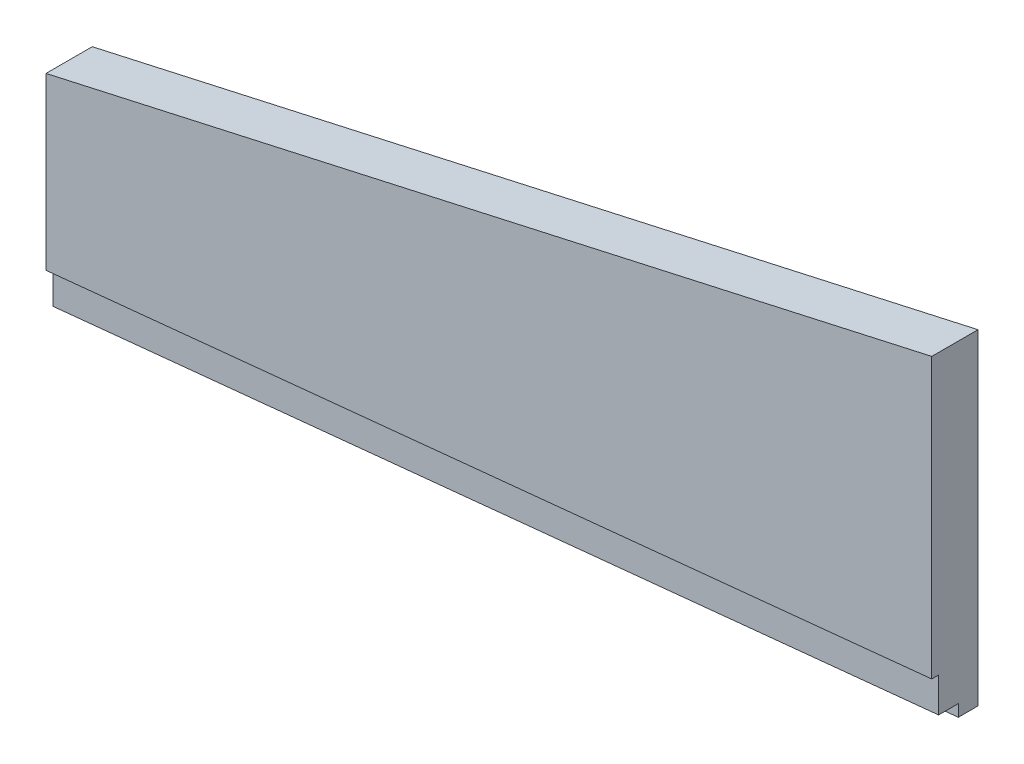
ISO-10303-21;
HEADER;
FILE_DESCRIPTION(('STEP AP214'),'2;1');
FILE_NAME('part.step','',(''),(''),'','','');
FILE_SCHEMA(('AUTOMOTIVE_DESIGN { 1 0 10303 214 1 1 1 1 }'));
ENDSEC;
DATA;
#1=APPLICATION_CONTEXT('core data for automotive mechanical design processes');
#2=APPLICATION_PROTOCOL_DEFINITION('international standard','automotive_design',2000,#1);
#3=PRODUCT_CONTEXT('',#1,'mechanical');
#4=PRODUCT('Part','Part','',(#3));
#5=PRODUCT_RELATED_PRODUCT_CATEGORY('part','',(#4));
#6=PRODUCT_DEFINITION_FORMATION('','',#4);
#7=PRODUCT_DEFINITION_CONTEXT('part definition',#1,'design');
#8=PRODUCT_DEFINITION('design','',#6,#7);
#9=PRODUCT_DEFINITION_SHAPE('','',#8);
#10=(LENGTH_UNIT() NAMED_UNIT(*) SI_UNIT(.MILLI.,.METRE.));
#11=(NAMED_UNIT(*) PLANE_ANGLE_UNIT() SI_UNIT($,.RADIAN.));
#12=(NAMED_UNIT(*) SI_UNIT($,.STERADIAN.) SOLID_ANGLE_UNIT());
#13=UNCERTAINTY_MEASURE_WITH_UNIT(LENGTH_MEASURE(1.E-05),#10,'distance_accuracy_value','');
#14=(GEOMETRIC_REPRESENTATION_CONTEXT(3) GLOBAL_UNCERTAINTY_ASSIGNED_CONTEXT((#13)) GLOBAL_UNIT_ASSIGNED_CONTEXT((#10,
#11,#12)) REPRESENTATION_CONTEXT('',''));
#15=CARTESIAN_POINT('',(0.,0.,0.));
#16=DIRECTION('',(0.,0.,1.));
#17=DIRECTION('',(1.,0.,0.));
#18=AXIS2_PLACEMENT_3D('',#15,#16,#17);
#19=CARTESIAN_POINT('',(1.50227168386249E-13,-1226.73843653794,47.));
#20=DIRECTION('',(0.217943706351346,-0.975961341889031,0.));
#21=DIRECTION('',(0.975961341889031,0.217943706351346,0.));
#22=AXIS2_PLACEMENT_3D('',#19,#20,#21);
#23=PLANE('',#22);
#24=DIRECTION('',(-0.975961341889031,-0.217943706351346,0.));
#25=VECTOR('',#24,1.);
#26=CARTESIAN_POINT('',(1.50227168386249E-13,-1226.73843653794,0.));
#27=LINE('',#26,#25);
#28=CARTESIAN_POINT('',(1.50227168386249E-13,-1226.73843653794,0.));
#29=VERTEX_POINT('',#28);
#30=CARTESIAN_POINT('',(-900.,-1427.71907716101,0.));
#31=VERTEX_POINT('',#30);
#32=EDGE_CURVE('E100',#29,#31,#27,.T.);
#33=ORIENTED_EDGE('',*,*,#32,.T.);
#34=DIRECTION('',(0.,0.,-1.));
#35=VECTOR('',#34,1.);
#36=CARTESIAN_POINT('',(-900.,-1427.71907716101,47.));
#37=LINE('',#36,#35);
#38=CARTESIAN_POINT('',(-900.,-1427.71907716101,47.));
#39=VERTEX_POINT('',#38);
#40=EDGE_CURVE('E11',#39,#31,#37,.T.);
#41=ORIENTED_EDGE('',*,*,#40,.F.);
#42=DIRECTION('',(-0.975961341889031,-0.217943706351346,0.));
#43=VECTOR('',#42,1.);
#44=CARTESIAN_POINT('',(1.50227168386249E-13,-1226.73843653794,47.));
#45=LINE('',#44,#43);
#46=CARTESIAN_POINT('',(1.50227168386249E-13,-1226.73843653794,47.));
#47=VERTEX_POINT('',#46);
#48=EDGE_CURVE('E104',#47,#39,#45,.T.);
#49=ORIENTED_EDGE('',*,*,#48,.F.);
#50=DIRECTION('',(0.,0.,-1.));
#51=VECTOR('',#50,1.);
#52=CARTESIAN_POINT('',(1.50227168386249E-13,-1226.73843653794,47.));
#53=LINE('',#52,#51);
#54=EDGE_CURVE('E156',#47,#29,#53,.T.);
#55=ORIENTED_EDGE('',*,*,#54,.T.);
#56=EDGE_LOOP('',(#33,#41,#49,#55));
#57=FACE_BOUND('',#56,.T.);
#58=ADVANCED_FACE('F31',(#57),#23,.F.);
#59=CARTESIAN_POINT('',(-900.,-1427.71907716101,47.));
#60=DIRECTION('',(1.,0.,0.));
#61=DIRECTION('',(0.,1.,0.));
#62=AXIS2_PLACEMENT_3D('',#59,#60,#61);
#63=PLANE('',#62);
#64=DIRECTION('',(0.,-1.,0.));
#65=VECTOR('',#64,1.);
#66=CARTESIAN_POINT('',(-900.,-1427.71907716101,0.));
#67=LINE('',#66,#65);
#68=CARTESIAN_POINT('',(-900.,-1648.23674209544,0.));
#69=VERTEX_POINT('',#68);
#70=EDGE_CURVE('E105',#31,#69,#67,.T.);
#71=ORIENTED_EDGE('',*,*,#70,.T.);
#72=DIRECTION('',(0.,0.,-1.));
#73=VECTOR('',#72,1.);
#74=CARTESIAN_POINT('',(-900.,-1648.23674209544,20.));
#75=LINE('',#74,#73);
#76=CARTESIAN_POINT('',(-900.,-1648.23674209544,20.));
#77=VERTEX_POINT('',#76);
#78=EDGE_CURVE('E115',#77,#69,#75,.T.);
#79=ORIENTED_EDGE('',*,*,#78,.F.);
#80=DIRECTION('',(0.,1.,0.));
#81=VECTOR('',#80,1.);
#82=CARTESIAN_POINT('',(-900.,-1636.1763635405,20.));
#83=LINE('',#82,#81);
#84=CARTESIAN_POINT('',(-900.,-1636.1763635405,20.));
#85=VERTEX_POINT('',#84);
#86=EDGE_CURVE('E116',#77,#85,#83,.T.);
#87=ORIENTED_EDGE('',*,*,#86,.T.);
#88=DIRECTION('',(0.,0.,-1.));
#89=VECTOR('',#88,1.);
#90=CARTESIAN_POINT('',(-900.,-1636.1763635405,40.));
#91=LINE('',#90,#89);
#92=CARTESIAN_POINT('',(-900.,-1636.1763635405,40.));
#93=VERTEX_POINT('',#92);
#94=EDGE_CURVE('E142',#93,#85,#91,.T.);
#95=ORIENTED_EDGE('',*,*,#94,.F.);
#96=DIRECTION('',(0.,1.,0.));
#97=VECTOR('',#96,1.);
#98=CARTESIAN_POINT('',(-900.,-1601.00025942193,40.));
#99=LINE('',#98,#97);
#100=CARTESIAN_POINT('',(-900.,-1601.00025942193,40.));
#101=VERTEX_POINT('',#100);
#102=EDGE_CURVE('E138',#93,#101,#99,.T.);
#103=ORIENTED_EDGE('',*,*,#102,.T.);
#104=DIRECTION('',(0.,0.,-1.));
#105=VECTOR('',#104,1.);
#106=CARTESIAN_POINT('',(-900.,-1601.00025942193,47.));
#107=LINE('',#106,#105);
#108=CARTESIAN_POINT('',(-900.,-1601.00025942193,47.));
#109=VERTEX_POINT('',#108);
#110=EDGE_CURVE('E38',#109,#101,#107,.T.);
#111=ORIENTED_EDGE('',*,*,#110,.F.);
#112=DIRECTION('',(0.,-1.,0.));
#113=VECTOR('',#112,1.);
#114=CARTESIAN_POINT('',(-900.,-1427.71907716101,47.));
#115=LINE('',#114,#113);
#116=EDGE_CURVE('E150',#39,#109,#115,.T.);
#117=ORIENTED_EDGE('',*,*,#116,.F.);
#118=ORIENTED_EDGE('',*,*,#40,.T.);
#119=EDGE_LOOP('',(#71,#79,#87,#95,#103,#111,#117,#118));
#120=FACE_BOUND('',#119,.T.);
#121=ADVANCED_FACE('F171',(#120),#63,.F.);
#122=CARTESIAN_POINT('',(1.84989439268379E-13,-1510.60329460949,47.));
#123=DIRECTION('',(-0.0999382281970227,0.994993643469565,0.));
#124=DIRECTION('',(-0.994993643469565,-0.0999382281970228,0.));
#125=AXIS2_PLACEMENT_3D('',#122,#123,#124);
#126=PLANE('',#125);
#127=ORIENTED_EDGE('',*,*,#110,.T.);
#128=DIRECTION('',(0.994993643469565,0.0999382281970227,0.));
#129=VECTOR('',#128,1.);
#130=CARTESIAN_POINT('',(1.84989439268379E-13,-1510.60329460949,40.));
#131=LINE('',#130,#129);
#132=CARTESIAN_POINT('',(1.84989439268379E-13,-1510.60329460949,40.));
#133=VERTEX_POINT('',#132);
#134=EDGE_CURVE('E48',#101,#133,#131,.T.);
#135=ORIENTED_EDGE('',*,*,#134,.T.);
#136=DIRECTION('',(0.,0.,-1.));
#137=VECTOR('',#136,1.);
#138=CARTESIAN_POINT('',(1.84989439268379E-13,-1510.60329460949,47.));
#139=LINE('',#138,#137);
#140=CARTESIAN_POINT('',(1.84989439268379E-13,-1510.60329460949,47.));
#141=VERTEX_POINT('',#140);
#142=EDGE_CURVE('E158',#141,#133,#139,.T.);
#143=ORIENTED_EDGE('',*,*,#142,.F.);
#144=DIRECTION('',(0.994993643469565,0.0999382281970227,0.));
#145=VECTOR('',#144,1.);
#146=CARTESIAN_POINT('',(1.84989439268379E-13,-1510.60329460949,47.));
#147=LINE('',#146,#145);
#148=EDGE_CURVE('E152',#109,#141,#147,.T.);
#149=ORIENTED_EDGE('',*,*,#148,.F.);
#150=EDGE_LOOP('',(#127,#135,#143,#149));
#151=FACE_BOUND('',#150,.T.);
#152=ADVANCED_FACE('F177',(#151),#126,.F.);
#153=CARTESIAN_POINT('',(1.50227168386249E-13,-1226.73843653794,47.));
#154=DIRECTION('',(-1.,0.,0.));
#155=DIRECTION('',(0.,-1.,0.));
#156=AXIS2_PLACEMENT_3D('',#153,#154,#155);
#157=PLANE('',#156);
#158=DIRECTION('',(0.,1.,0.));
#159=VECTOR('',#158,1.);
#160=CARTESIAN_POINT('',(1.50227168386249E-13,-1226.73843653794,0.));
#161=LINE('',#160,#159);
#162=CARTESIAN_POINT('',(0.,-1557.839777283,0.));
#163=VERTEX_POINT('',#162);
#164=EDGE_CURVE('E94',#163,#29,#161,.T.);
#165=ORIENTED_EDGE('',*,*,#164,.T.);
#166=ORIENTED_EDGE('',*,*,#54,.F.);
#167=DIRECTION('',(0.,1.,0.));
#168=VECTOR('',#167,1.);
#169=CARTESIAN_POINT('',(1.50227168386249E-13,-1226.73843653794,47.));
#170=LINE('',#169,#168);
#171=EDGE_CURVE('E154',#141,#47,#170,.T.);
#172=ORIENTED_EDGE('',*,*,#171,.F.);
#173=ORIENTED_EDGE('',*,*,#142,.T.);
#174=DIRECTION('',(0.,-1.,0.));
#175=VECTOR('',#174,1.);
#176=CARTESIAN_POINT('',(1.84989439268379E-13,-1510.60329460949,40.));
#177=LINE('',#176,#175);
#178=CARTESIAN_POINT('',(0.,-1545.77939872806,40.));
#179=VERTEX_POINT('',#178);
#180=EDGE_CURVE('E132',#133,#179,#177,.T.);
#181=ORIENTED_EDGE('',*,*,#180,.T.);
#182=DIRECTION('',(0.,0.,-1.));
#183=VECTOR('',#182,1.);
#184=CARTESIAN_POINT('',(0.,-1545.77939872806,40.));
#185=LINE('',#184,#183);
#186=CARTESIAN_POINT('',(0.,-1545.77939872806,20.));
#187=VERTEX_POINT('',#186);
#188=EDGE_CURVE('E141',#179,#187,#185,.T.);
#189=ORIENTED_EDGE('',*,*,#188,.T.);
#190=DIRECTION('',(0.,-1.,0.));
#191=VECTOR('',#190,1.);
#192=CARTESIAN_POINT('',(0.,-1545.77939872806,20.));
#193=LINE('',#192,#191);
#194=CARTESIAN_POINT('',(0.,-1557.839777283,20.));
#195=VERTEX_POINT('',#194);
#196=EDGE_CURVE('E111',#187,#195,#193,.T.);
#197=ORIENTED_EDGE('',*,*,#196,.T.);
#198=DIRECTION('',(0.,0.,-1.));
#199=VECTOR('',#198,1.);
#200=CARTESIAN_POINT('',(0.,-1557.839777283,20.));
#201=LINE('',#200,#199);
#202=EDGE_CURVE('E108',#195,#163,#201,.T.);
#203=ORIENTED_EDGE('',*,*,#202,.T.);
#204=EDGE_LOOP('',(#165,#166,#172,#173,#181,#189,#197,#203));
#205=FACE_BOUND('',#204,.T.);
#206=ADVANCED_FACE('F109',(#205),#157,.F.);
#207=CARTESIAN_POINT('',(1.50227168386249E-13,-1226.73843653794,47.));
#208=DIRECTION('',(0.,0.,1.));
#209=DIRECTION('',(1.,0.,0.));
#210=AXIS2_PLACEMENT_3D('',#207,#208,#209);
#211=PLANE('',#210);
#212=ORIENTED_EDGE('',*,*,#48,.T.);
#213=ORIENTED_EDGE('',*,*,#116,.T.);
#214=ORIENTED_EDGE('',*,*,#148,.T.);
#215=ORIENTED_EDGE('',*,*,#171,.T.);
#216=EDGE_LOOP('',(#212,#213,#214,#215));
#217=FACE_BOUND('',#216,.T.);
#218=ADVANCED_FACE('F176',(#217),#211,.T.);
#219=CARTESIAN_POINT('',(1.50227168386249E-13,-1226.73843653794,0.));
#220=DIRECTION('',(0.,0.,1.));
#221=DIRECTION('',(1.,0.,0.));
#222=AXIS2_PLACEMENT_3D('',#219,#220,#221);
#223=PLANE('',#222);
#224=ORIENTED_EDGE('',*,*,#32,.F.);
#225=ORIENTED_EDGE('',*,*,#164,.F.);
#226=DIRECTION('',(-0.994993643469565,-0.0999382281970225,0.));
#227=VECTOR('',#226,1.);
#228=CARTESIAN_POINT('',(-900.,-1648.23674209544,0.));
#229=LINE('',#228,#227);
#230=EDGE_CURVE('E98',#163,#69,#229,.T.);
#231=ORIENTED_EDGE('',*,*,#230,.T.);
#232=ORIENTED_EDGE('',*,*,#70,.F.);
#233=EDGE_LOOP('',(#224,#225,#231,#232));
#234=FACE_BOUND('',#233,.T.);
#235=ADVANCED_FACE('F96',(#234),#223,.F.);
#236=CARTESIAN_POINT('',(-900.,-1636.1763635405,40.));
#237=DIRECTION('',(0.0999382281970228,-0.994993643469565,0.));
#238=DIRECTION('',(0.994993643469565,0.0999382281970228,0.));
#239=AXIS2_PLACEMENT_3D('',#236,#237,#238);
#240=PLANE('',#239);
#241=DIRECTION('',(0.994993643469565,0.0999382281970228,0.));
#242=VECTOR('',#241,1.);
#243=CARTESIAN_POINT('',(0.,-1545.77939872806,20.));
#244=LINE('',#243,#242);
#245=EDGE_CURVE('E120',#85,#187,#244,.T.);
#246=ORIENTED_EDGE('',*,*,#245,.T.);
#247=ORIENTED_EDGE('',*,*,#188,.F.);
#248=DIRECTION('',(-0.994993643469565,-0.0999382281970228,0.));
#249=VECTOR('',#248,1.);
#250=CARTESIAN_POINT('',(-900.,-1636.1763635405,40.));
#251=LINE('',#250,#249);
#252=EDGE_CURVE('E135',#179,#93,#251,.T.);
#253=ORIENTED_EDGE('',*,*,#252,.T.);
#254=ORIENTED_EDGE('',*,*,#94,.T.);
#255=EDGE_LOOP('',(#246,#247,#253,#254));
#256=FACE_BOUND('',#255,.T.);
#257=ADVANCED_FACE('F166',(#256),#240,.T.);
#258=CARTESIAN_POINT('',(-900.,-1601.00025942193,40.));
#259=DIRECTION('',(0.,0.,1.));
#260=DIRECTION('',(1.,0.,0.));
#261=AXIS2_PLACEMENT_3D('',#258,#259,#260);
#262=PLANE('',#261);
#263=ORIENTED_EDGE('',*,*,#134,.F.);
#264=ORIENTED_EDGE('',*,*,#102,.F.);
#265=ORIENTED_EDGE('',*,*,#252,.F.);
#266=ORIENTED_EDGE('',*,*,#180,.F.);
#267=EDGE_LOOP('',(#263,#264,#265,#266));
#268=FACE_BOUND('',#267,.T.);
#269=ADVANCED_FACE('F163',(#268),#262,.T.);
#270=CARTESIAN_POINT('',(-900.,-1648.23674209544,20.));
#271=DIRECTION('',(0.0999382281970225,-0.994993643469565,0.));
#272=DIRECTION('',(0.994993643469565,0.0999382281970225,0.));
#273=AXIS2_PLACEMENT_3D('',#270,#271,#272);
#274=PLANE('',#273);
#275=ORIENTED_EDGE('',*,*,#230,.F.);
#276=ORIENTED_EDGE('',*,*,#202,.F.);
#277=DIRECTION('',(-0.994993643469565,-0.0999382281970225,0.));
#278=VECTOR('',#277,1.);
#279=CARTESIAN_POINT('',(-900.,-1648.23674209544,20.));
#280=LINE('',#279,#278);
#281=EDGE_CURVE('E126',#195,#77,#280,.T.);
#282=ORIENTED_EDGE('',*,*,#281,.T.);
#283=ORIENTED_EDGE('',*,*,#78,.T.);
#284=EDGE_LOOP('',(#275,#276,#282,#283));
#285=FACE_BOUND('',#284,.T.);
#286=ADVANCED_FACE('F119',(#285),#274,.T.);
#287=CARTESIAN_POINT('',(-900.,-1636.1763635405,20.));
#288=DIRECTION('',(0.,0.,1.));
#289=DIRECTION('',(1.,0.,0.));
#290=AXIS2_PLACEMENT_3D('',#287,#288,#289);
#291=PLANE('',#290);
#292=ORIENTED_EDGE('',*,*,#245,.F.);
#293=ORIENTED_EDGE('',*,*,#86,.F.);
#294=ORIENTED_EDGE('',*,*,#281,.F.);
#295=ORIENTED_EDGE('',*,*,#196,.F.);
#296=EDGE_LOOP('',(#292,#293,#294,#295));
#297=FACE_BOUND('',#296,.T.);
#298=ADVANCED_FACE('F169',(#297),#291,.T.);
#299=CLOSED_SHELL('',(#58,#121,#152,#206,#218,#235,#257,#269,#286,#298));
#300=MANIFOLD_SOLID_BREP('B2',#299);
#301=ADVANCED_BREP_SHAPE_REPRESENTATION('',(#18,#300),#14);
#302=SHAPE_DEFINITION_REPRESENTATION(#9,#301);
ENDSEC;
END-ISO-10303-21;
